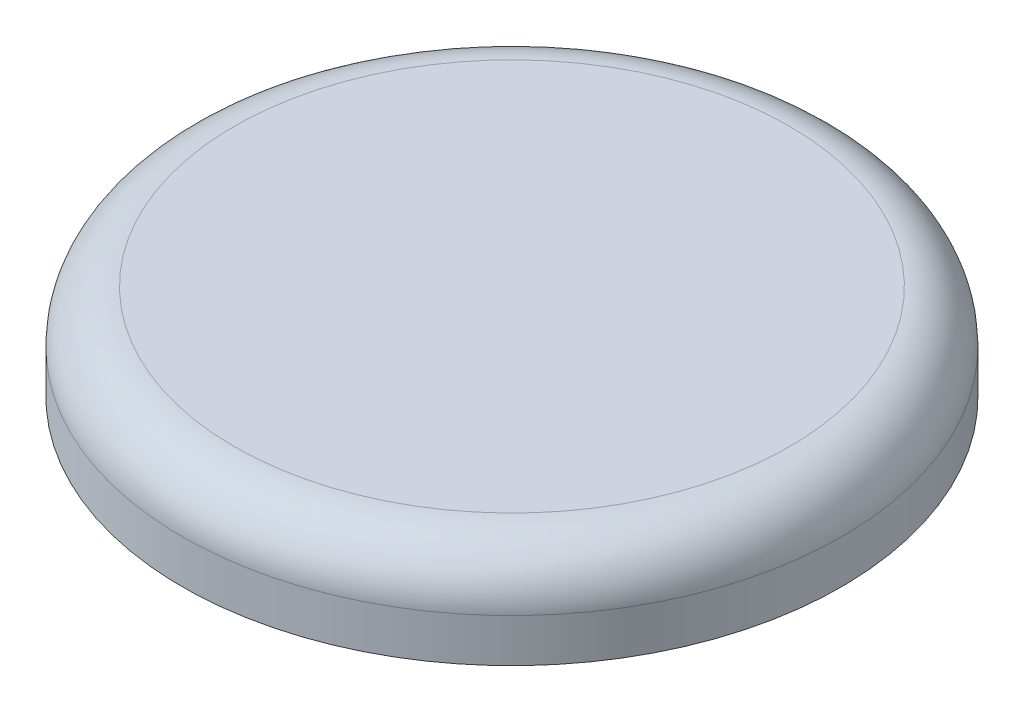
from build123d import *

# Parameters (mm, degrees)
CONG_1_R       = 3
CONG_2_R       = 1
ECHELLE1_SCALE = 1.018


with BuildPart() as part:
    # Esquisse1 → R_volution1 (revolve)
    with BuildSketch(Plane.XY, mode=Mode.PRIVATE) as r_volution1_sk:
        Polygon((0, 0), (-19, 0), (-19, -5.5), (-16.5, -5.5), (-16.193789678, -2), (-9.5, -2), (-9.5, -12), (-7.625, -12), (-7.188390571, -2), (0, -2), align=None)
    revolve(r_volution1_sk.sketch.rotate(Axis((0, 0, 0), (0, 1, 0)), 270), axis=Axis((0, 0, 0), (0, 1, 0)))

    # Cong_1
    cong_1_edges = [part.edges().sort_by_distance(p)[0] for p in [
        (0, 0, 19),
    ]]
    fillet(cong_1_edges, radius=CONG_1_R)

    # Cong_2
    cong_2_edges = [part.edges().sort_by_distance(p)[0] for p in [
        (0, -2, 9.5),
        (0, -2, 16.193789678),
    ]]
    fillet(cong_2_edges, radius=CONG_2_R)

    # Esquisse2 → Enl_vement de mati_re-R_volution1 (revolve, cut)
    with BuildSketch(Plane.XY, mode=Mode.PRIVATE) as enl_vement_de_mati_re_r_volution1_sk:
        with BuildLine():
            Line((-7.383531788, -6.469468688), (-7.426545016, -7.454633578))
            ThreePointArc((-7.426545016, -7.454633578), (-7.534914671, -6.956380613), (-7.383531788, -6.469468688))
        make_face()
    revolve(enl_vement_de_mati_re_r_volution1_sk.sketch.rotate(Axis((0, 0, 0), (0, -1, 0)), 270), axis=Axis((0, 0, 0), (0, -1, 0)), mode=Mode.SUBTRACT)


with BuildPart() as part_1:
    # Echelle1: scaled about (0, 0, 0)
    add(part.part.scale(ECHELLE1_SCALE))


solid = part_1.part
